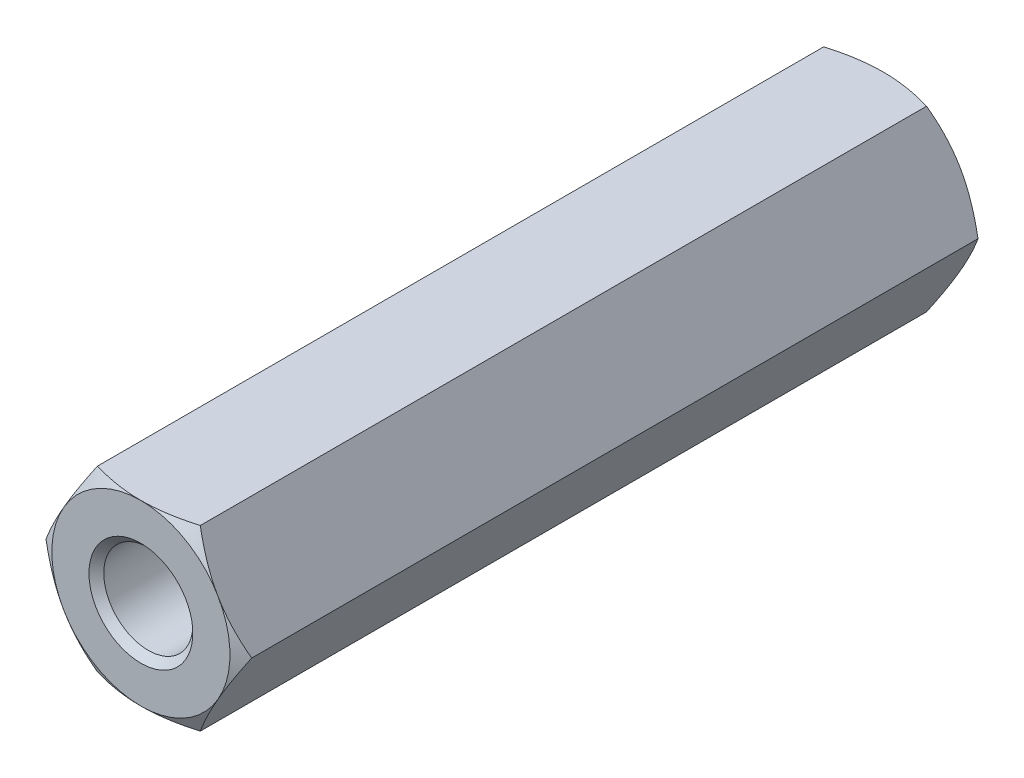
from build123d import *

# Parameters (mm, degrees)
BOSS_EXTRUDE1_DEPTH      = 12.5
SKETCH2_OUTSIDE_W        = 61.612
SKETCH2_OUTSIDE_H        = 60.684
SKETCH2_OUTSIDE_R        = 3
CUT_EXTRUDE1_DEPTH       = 14.313526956
CUT_EXTRUDE1_DRAFT       = -60
SKETCH3_R                = 1.5
SKETCH3_R_2              = 1.25
CUT_EXTRUDE2_DEPTH       = 7
SKETCH3_2_R              = 1.25
CUT_EXTRUDE3_DEPTH       = 10.75
CHAMFER1_SIZE            = 0.25
MIRROR1_COPY_1_SKETCH_W  = 61.612
MIRROR1_COPY_1_SKETCH_H  = 60.684
MIRROR1_COPY_1_SKETCH_R  = 3
MIRROR1_COPY_1_DEPTH     = 14.313526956
MIRROR1_COPY_1_DRAFT     = -60
CHAMFER1_OF_MIRROR1_SIZE = 0.25


with BuildPart() as part:
    # Sketch1 → Boss-Extrude1 (new body)
    with BuildSketch(Plane.XY):
        Polygon((1.732050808, 3), (-1.732050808, 3), (-3.464101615, 0), (-1.732050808, -3), (1.732050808, -3), (3.464101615, 0), align=None)
    boss_extrude1 = extrude(amount=-BOSS_EXTRUDE1_DEPTH)


with BuildPart() as cut_extrude1_tool:
    # Sketch2 outside → Cut-Extrude1 (with draft: the straight prism first)
    with BuildSketch(Plane(origin=(0, 0, -12.5), x_dir=(-1, 0, 0), z_dir=(0, 0, -1))):
        Rectangle(SKETCH2_OUTSIDE_W, SKETCH2_OUTSIDE_H)
        Circle(SKETCH2_OUTSIDE_R, mode=Mode.SUBTRACT)
    extrude(amount=-CUT_EXTRUDE1_DEPTH)
    # Cut-Extrude1: the draft: its side faces are tilted about the plane it starts from
    cut_extrude1_sides = [cut_extrude1_tool.faces().sort_by_distance(p)[0] for p in [
        (0, -30.342, -5.343236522),
        (-30.806, 0, -5.343236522),
        (0, 30.342, -5.343236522),
        (30.806, 0, -5.343236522),
        (3, 0, -5.343236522),
    ]]
    draft(cut_extrude1_sides, Plane(origin=(0, 0, -12.5), x_dir=(-1, 0, 0), z_dir=(0, 0, -1)), CUT_EXTRUDE1_DRAFT)


with BuildPart() as part_1:
    add(part.part)

    # Cut-Extrude1: cut by cut_extrude1_tool
    add(cut_extrude1_tool.part, mode=Mode.SUBTRACT)

    # Sketch3 → Cut-Extrude2 (cut)
    with BuildSketch(Plane(origin=(0, 0, -12.5), x_dir=(-1, 0, 0), z_dir=(0, 0, -1))):
        Circle(SKETCH3_R)
        Circle(SKETCH3_R_2, mode=Mode.SUBTRACT)
    cut_extrude2 = extrude(amount=-CUT_EXTRUDE2_DEPTH, mode=Mode.SUBTRACT)

    # Sketch3_2 → Cut-Extrude3 (cut)
    with BuildSketch(Plane(origin=(0, 0, -12.5), x_dir=(-1, 0, 0), z_dir=(0, 0, -1))):
        Circle(SKETCH3_2_R)
    cut_extrude3 = extrude(amount=-CUT_EXTRUDE3_DEPTH, mode=Mode.SUBTRACT)

    # Chamfer1
    chamfer1_edges = [part_1.edges().sort_by_distance(p)[0] for p in [
        (1.5, 0, -12.5),
    ]]
    chamfer(chamfer1_edges, length=CHAMFER1_SIZE)

    # Mirror1: Boss-Extrude1, Cut-Extrude2, Cut-Extrude3 across plane
    add(boss_extrude1.mirror(Plane.XY))
    add(cut_extrude2.mirror(Plane.XY), mode=Mode.SUBTRACT)
    add(cut_extrude3.mirror(Plane.XY), mode=Mode.SUBTRACT)


with BuildPart() as mirror1_copy_1_tool:
    # Mirror1 copy 1 sketch → Mirror1 copy 1 (with draft: the straight prism first)
    with BuildSketch(Plane(origin=(0, 0, 12.5), x_dir=(-1, 0, 0), z_dir=(0, 0, 1))):
        Rectangle(MIRROR1_COPY_1_SKETCH_W, MIRROR1_COPY_1_SKETCH_H)
        Circle(MIRROR1_COPY_1_SKETCH_R, mode=Mode.SUBTRACT)
    extrude(amount=-MIRROR1_COPY_1_DEPTH)
    # Mirror1 copy 1: the draft: its side faces are tilted about the plane it starts from
    mirror1_copy_1_sides = [mirror1_copy_1_tool.faces().sort_by_distance(p)[0] for p in [
        (0, -30.342, 5.343236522),
        (-30.806, 0, 5.343236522),
        (0, 30.342, 5.343236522),
        (30.806, 0, 5.343236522),
        (3, 0, 5.343236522),
    ]]
    draft(mirror1_copy_1_sides, Plane(origin=(0, 0, 12.5), x_dir=(-1, 0, 0), z_dir=(0, 0, 1)), MIRROR1_COPY_1_DRAFT)


with BuildPart() as part_2:
    add(part_1.part)

    # Mirror1 copy 1: cut by mirror1_copy_1_tool
    add(mirror1_copy_1_tool.part, mode=Mode.SUBTRACT)

    # Chamfer1 of Mirror1
    chamfer1_of_mirror1_edges = [part_2.edges().sort_by_distance(p)[0] for p in [
        (1.5, 0, 12.5),
    ]]
    chamfer(chamfer1_of_mirror1_edges, length=CHAMFER1_OF_MIRROR1_SIZE)


solid = part_2.part
